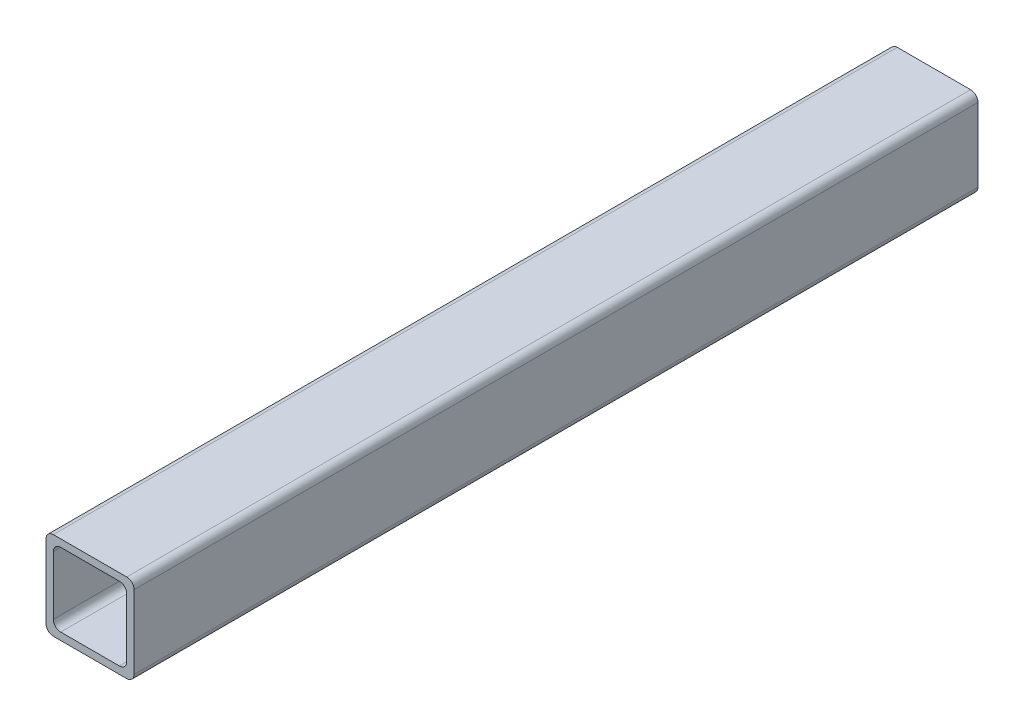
from build123d import *

# Parameters (mm, degrees)
BOSS_EXTRUDE1_DEPTH = 575
SKETCH2_R           = 8.5
CUT_EXTRUDE1_DEPTH  = 10


with BuildPart() as part:
    # Sketch1 → Boss-Extrude1 (new, symmetric)
    with BuildSketch(Plane.XY):
        with BuildLine():
            Line((-50, -60), (50, -60))
            ThreePointArc((50, -60), (57.071067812, -57.071067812), (60, -50))
            Line((60, -50), (60, 50))
            ThreePointArc((60, 50), (57.071067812, 57.071067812), (50, 60))
            Line((50, 60), (-50, 60))
            ThreePointArc((-50, 60), (-57.071067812, 57.071067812), (-60, 50))
            Line((-60, 50), (-60, -50))
            ThreePointArc((-60, -50), (-57.071067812, -57.071067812), (-50, -60))
        make_face()
        with BuildLine():
            Line((-40, -50), (40, -50))
            ThreePointArc((40, -50), (47.071067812, -47.071067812), (50, -40))
            Line((50, -40), (50, 40))
            ThreePointArc((50, 40), (47.071067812, 47.071067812), (40, 50))
            Line((40, 50), (-40, 50))
            ThreePointArc((-40, 50), (-47.071067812, 47.071067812), (-50, 40))
            Line((-50, 40), (-50, -40))
            ThreePointArc((-50, -40), (-47.071067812, -47.071067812), (-40, -50))
        make_face(mode=Mode.SUBTRACT)
    extrude(amount=BOSS_EXTRUDE1_DEPTH, both=True)

    # Sketch2 → Cut-Extrude1 (cut)
    with BuildSketch(Plane.XZ.offset(60)):
        with Locations(Location((0, 498.5, 0), (0, 0, 270))):
            Circle(SKETCH2_R)
        with Locations(Location((0, -498.5, 0), (0, 0, 90))):
            Circle(SKETCH2_R)
    extrude(amount=-CUT_EXTRUDE1_DEPTH, mode=Mode.SUBTRACT)


solid = part.part
